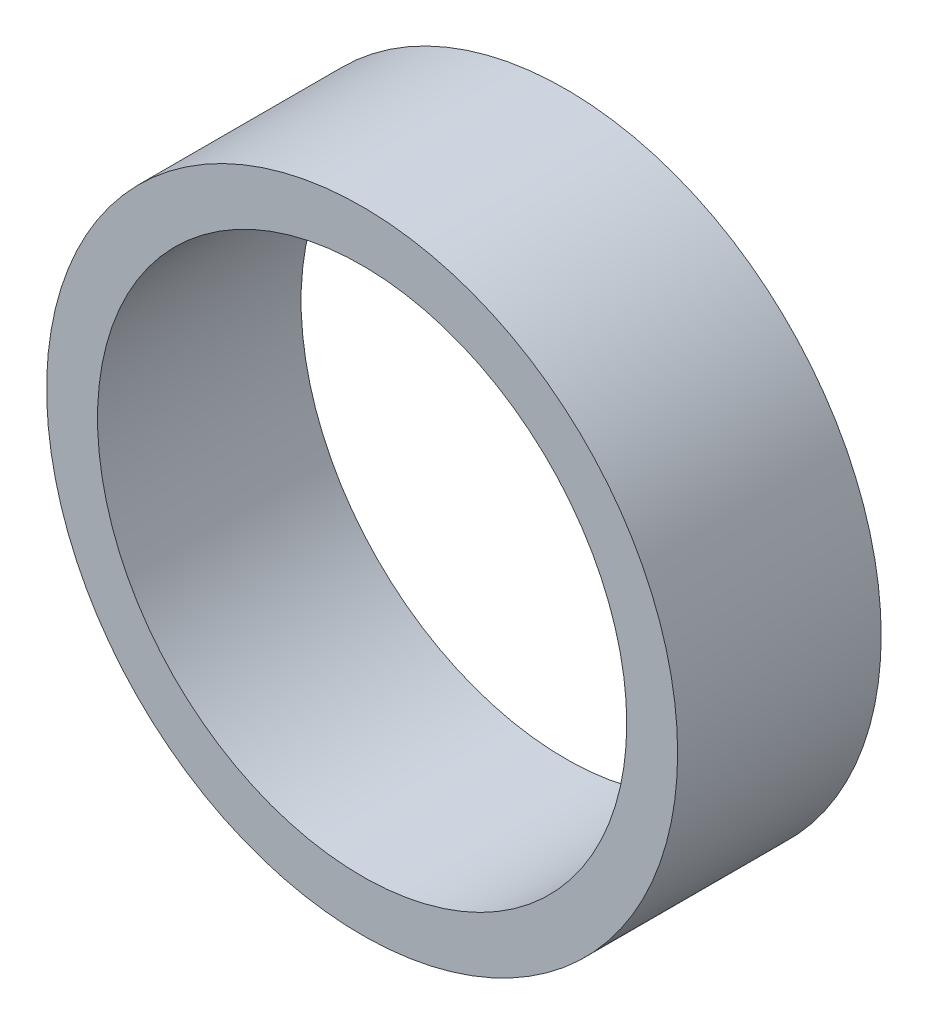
from build123d import *

# Parameters (mm, degrees)
SKETCH1_R      = 31
SKETCH1_R_2    = 26
EXTRUDE1_DEPTH = 20


with BuildPart() as part:
    # Sketch1 → Extrude1 (new body)
    with BuildSketch(Plane.XY):
        Circle(SKETCH1_R)
        Circle(SKETCH1_R_2, mode=Mode.SUBTRACT)
    extrude(amount=EXTRUDE1_DEPTH)


solid = part.part
